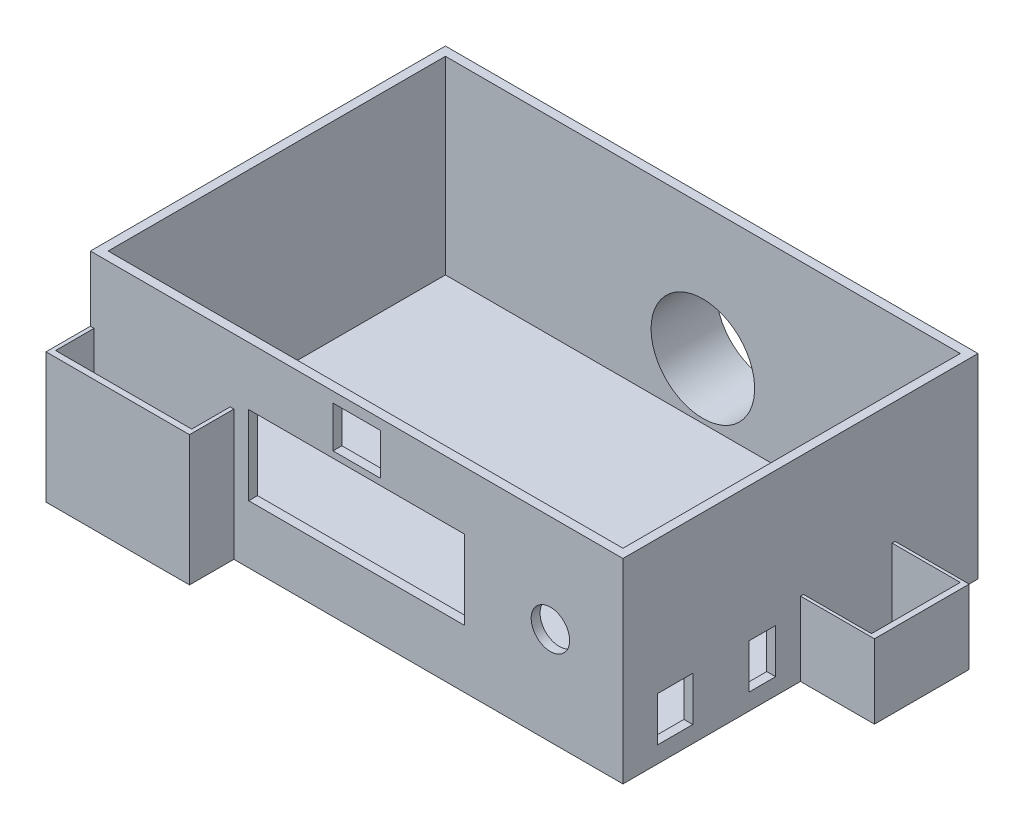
from build123d import *

# Parameters (mm, degrees)
SKETCH1_W           = 180
SKETCH1_H           = 120
BOSS_EXTRUDE1_DEPTH = 66
SKETCH2_W           = 174
SKETCH2_H           = 114
CUT_EXTRUDE1_DEPTH  = 64
CUT_EXTRUDE2_REACH  = 165.878
SKETCH3_R           = 6.5
SKETCH3_W           = 73
SKETCH3_H           = 26.7
CUT_EXTRUDE3_REACH  = 202.888
SKETCH4_W           = 12
SKETCH4_H           = 15
SKETCH4_W_2         = 9
SKETCH5_W           = 32
SKETCH5_H           = 25
BOSS_EXTRUDE2_DEPTH = 25
SKETCH6_W           = 23
SKETCH6_H           = 30
CUT_EXTRUDE4_DEPTH  = 23
SKETCH8_W           = 48.5
SKETCH8_H           = 44
BOSS_EXTRUDE3_DEPTH = 15
SKETCH9_W           = 46
SKETCH9_H           = 13
CUT_EXTRUDE5_DEPTH  = 42
CUT_EXTRUDE6_REACH  = 180.832
SKETCH11_W          = 16
SKETCH11_H          = 14
SKETCH13_R          = 17.5
CUT_EXTRUDE7_DEPTH  = 3
BOSS_EXTRUDE5_START = 19
SKETCH14_R          = 20.5
SKETCH14_R_2        = 17.5
BOSS_EXTRUDE5_DEPTH = 19


with BuildPart() as part:
    # Sketch1 → Boss-Extrude1 (new body)
    with BuildSketch(Plane(origin=(0, 0, 0), x_dir=(1, 0, 0), z_dir=(0, 1, 0))):
        Rectangle(SKETCH1_W, SKETCH1_H)
    extrude(amount=BOSS_EXTRUDE1_DEPTH)

    # Sketch2 → Cut-Extrude1 (cut)
    with BuildSketch(Plane(origin=(0, 66, 0), x_dir=(1, 0, 0), z_dir=(0, 1, 0))):
        Rectangle(SKETCH2_W, SKETCH2_H)
    extrude(amount=-CUT_EXTRUDE1_DEPTH, mode=Mode.SUBTRACT)

    # Sketch3 → Cut-Extrude2 (cut, up to next)
    with BuildSketch(Plane.XY.offset(60), mode=Mode.PRIVATE) as cut_extrude2_sk1:
        with Locations((65.477857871, 33)):
            Circle(SKETCH3_R)
    cut_extrude2_tool1 = extrude(cut_extrude2_sk1.sketch, amount=-CUT_EXTRUDE2_REACH, mode=Mode.PRIVATE) & part.part
    # Sketch3 → Cut-Extrude2 (cut, up to next)
    with BuildSketch(Plane.XY.offset(60), mode=Mode.PRIVATE) as cut_extrude2_sk2:
        with Locations((0, 33)):
            Rectangle(SKETCH3_W, SKETCH3_H)
    cut_extrude2_tool2 = extrude(cut_extrude2_sk2.sketch, amount=-CUT_EXTRUDE2_REACH, mode=Mode.PRIVATE) & part.part
    add(cut_extrude2_tool1.solids().sort_by_distance((65.477858, 33, 60))[0], mode=Mode.SUBTRACT)
    add(cut_extrude2_tool2.solids().sort_by_distance((0, 33, 60))[0], mode=Mode.SUBTRACT)

    # Sketch4 → Cut-Extrude3 (cut, up to next)
    with BuildSketch(Plane(origin=(90, 0, 0), x_dir=(0, 0, -1), z_dir=(1, 0, 0)), mode=Mode.PRIVATE) as cut_extrude3_sk1:
        with Locations((-42.4, 13.1)):
            Rectangle(SKETCH4_W, SKETCH4_H)
    cut_extrude3_tool1 = extrude(cut_extrude3_sk1.sketch, amount=-CUT_EXTRUDE3_REACH, mode=Mode.PRIVATE) & part.part
    # Sketch4 → Cut-Extrude3 (cut, up to next)
    with BuildSketch(Plane(origin=(90, 0, 0), x_dir=(0, 0, -1), z_dir=(1, 0, 0)), mode=Mode.PRIVATE) as cut_extrude3_sk2:
        with Locations((-12.9, 13.1)):
            Rectangle(SKETCH4_W_2, SKETCH4_H)
    cut_extrude3_tool2 = extrude(cut_extrude3_sk2.sketch, amount=-CUT_EXTRUDE3_REACH, mode=Mode.PRIVATE) & part.part
    add(cut_extrude3_tool1.solids().sort_by_distance((90, 13.1, 42.4))[0], mode=Mode.SUBTRACT)
    add(cut_extrude3_tool2.solids().sort_by_distance((90, 13.1, 12.9))[0], mode=Mode.SUBTRACT)

    # Sketch5 → Boss-Extrude2 (add)
    with BuildSketch(Plane(origin=(90, 0, 0), x_dir=(0, 0, -1), z_dir=(1, 0, 0))):
        with Locations((16, 12.5)):
            Rectangle(SKETCH5_W, SKETCH5_H)
    extrude(amount=BOSS_EXTRUDE2_DEPTH)

    # Sketch6 → Cut-Extrude4 (cut)
    with BuildSketch(Plane(origin=(0, 25, 0), x_dir=(1, 0, 0), z_dir=(0, 1, 0))):
        with Locations((101.5, 16)):
            Rectangle(SKETCH6_W, SKETCH6_H)
    extrude(amount=-CUT_EXTRUDE4_DEPTH, mode=Mode.SUBTRACT)

    # Sketch8 → Boss-Extrude3 (add)
    with BuildSketch(Plane.XY.offset(60)):
        with Locations((-65.75, 22)):
            Rectangle(SKETCH8_W, SKETCH8_H)
    extrude(amount=BOSS_EXTRUDE3_DEPTH)

    # Sketch9 → Cut-Extrude5 (cut)
    with BuildSketch(Plane(origin=(0, 44, 0), x_dir=(1, 0, 0), z_dir=(0, 1, 0))):
        with Locations((-65.75, -66.5)):
            Rectangle(SKETCH9_W, SKETCH9_H)
    extrude(amount=-CUT_EXTRUDE5_DEPTH, mode=Mode.SUBTRACT)

    # Sketch11 → Cut-Extrude6 (cut, up to next)
    with BuildSketch(Plane.XY.offset(60), mode=Mode.PRIVATE) as cut_extrude6_sk1:
        with Locations((0, 55.5)):
            Rectangle(SKETCH11_W, SKETCH11_H)
    cut_extrude6_tool1 = extrude(cut_extrude6_sk1.sketch, amount=-CUT_EXTRUDE6_REACH, mode=Mode.PRIVATE) & part.part
    add(cut_extrude6_tool1.solids().sort_by_distance((0, 55.5, 60))[0], mode=Mode.SUBTRACT)

    # Sketch13 → Cut-Extrude7 (cut)
    with BuildSketch(Plane(origin=(0, 0, -60), x_dir=(-1, 0, 0), z_dir=(0, 0, -1))):
        with Locations((0, 21)):
            Circle(SKETCH13_R)
    extrude(amount=-CUT_EXTRUDE7_DEPTH, mode=Mode.SUBTRACT)

    # Sketch14 → Boss-Extrude5 (add)
    with BuildSketch(Plane(origin=(0, 0, -60), x_dir=(-1, 0, 0), z_dir=(0, 0, -1)).offset(BOSS_EXTRUDE5_START)):
        with Locations(Location((0, 21, 0), (0, 0, 180))):
            Circle(SKETCH14_R)
        with Locations((0, 21)):
            Circle(SKETCH14_R_2, mode=Mode.SUBTRACT)
    extrude(amount=-BOSS_EXTRUDE5_DEPTH)


solid = part.part
